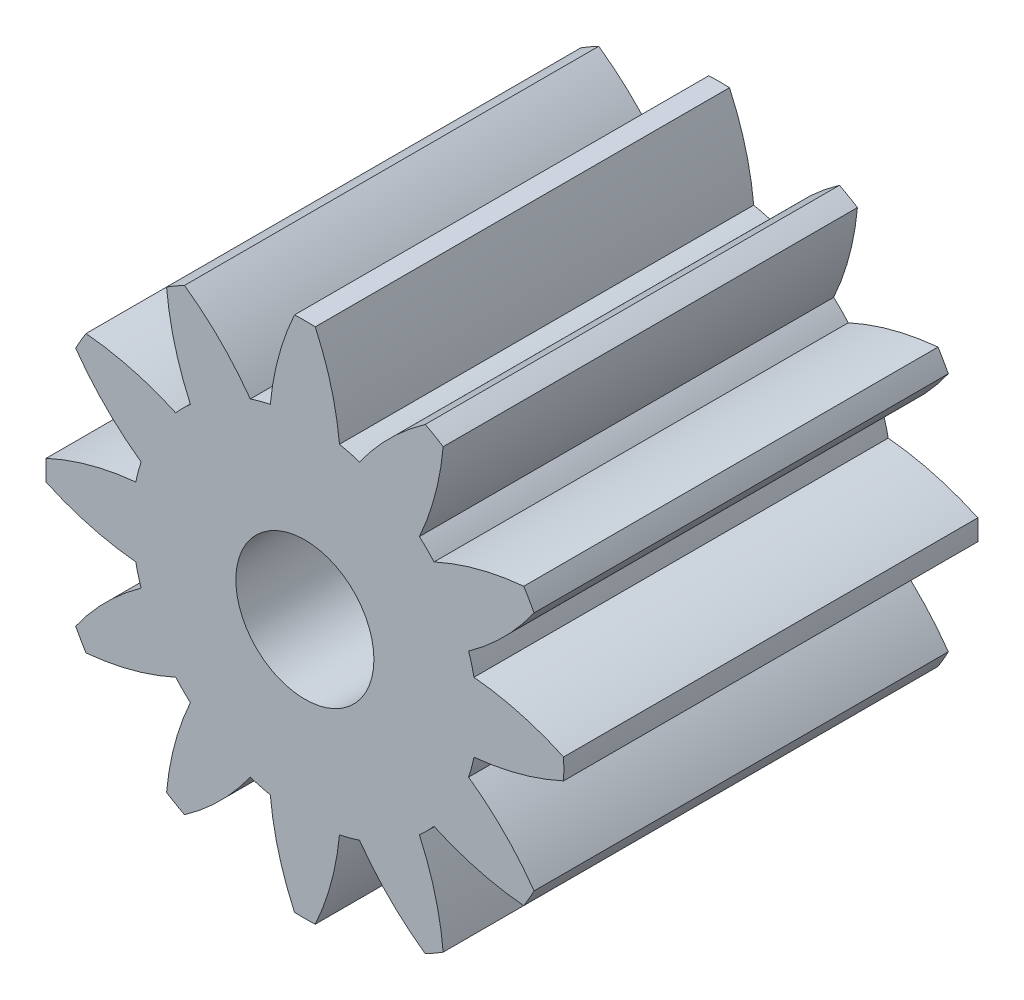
from build123d import *

# Parameters (mm, degrees)
ESQUISSE2_R                  = 3.75
ESQUISSE2_R_2                = 1
BASE_EXTRUSION_DEPTH         = 6
ENL_V_MAT_EXTRU_2_DEPTH      = 9.007808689
R_P_TITION_CIRCULAIRE2_COUNT = 12


with BuildPart() as part:
    # Esquisse2 → Base-Extrusion (new body)
    with BuildSketch(Plane.XY):
        Circle(ESQUISSE2_R)
        Circle(ESQUISSE2_R_2, mode=Mode.SUBTRACT)
    extrude(amount=BASE_EXTRUSION_DEPTH)

    # Esquisse3 → Enl_v. mat.-Extru.2 (cut, through all)
    with BuildSketch(Plane.XY.offset(6)):
        with BuildLine():
            Line((0.647047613, 2.414814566), (1.944990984, 7.258805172))
            Line((1.944990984, 7.258805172), (-1.944990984, 7.258805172))
            Line((-1.944990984, 7.258805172), (-0.647047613, 2.414814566))
            ThreePointArc((-0.647047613, 2.414814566), (-0.574279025, 2.433146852), (-0.500993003, 2.449286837))
            ThreePointArc((-0.500993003, 2.449286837), (-0.380404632, 3.112993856), (-0.15, 3.746998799))
            ThreePointArc((-0.15, 3.746998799), (0, 3.75), (0.15, 3.746998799))
            ThreePointArc((0.15, 3.746998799), (0.380404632, 3.112993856), (0.500993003, 2.449286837))
            ThreePointArc((0.500993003, 2.449286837), (0.574279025, 2.433146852), (0.647047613, 2.414814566))
        make_face()
    enl_v_mat_extru_2 = extrude(amount=-ENL_V_MAT_EXTRU_2_DEPTH, mode=Mode.SUBTRACT)

    # R_p_tition circulaire2: Enl_v. mat.-Extru.2 ×12 about axis
    r_p_tition_circulaire2_axis = Axis((0, 0, 0), (0, 0, 1))
    for i in range(1, R_P_TITION_CIRCULAIRE2_COUNT):
        add(enl_v_mat_extru_2.rotate(r_p_tition_circulaire2_axis, i * 360 / R_P_TITION_CIRCULAIRE2_COUNT), mode=Mode.SUBTRACT)


solid = part.part
